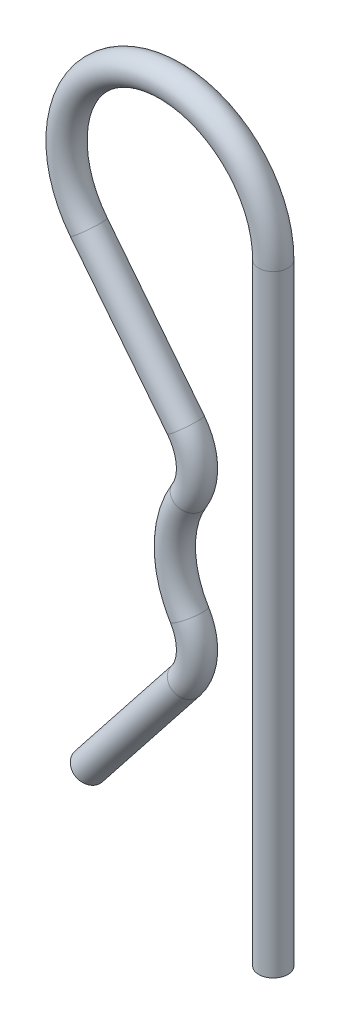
ISO-10303-21;
HEADER;
FILE_DESCRIPTION(('STEP AP214'),'2;1');
FILE_NAME('part.step','',(''),(''),'','','');
FILE_SCHEMA(('AUTOMOTIVE_DESIGN { 1 0 10303 214 1 1 1 1 }'));
ENDSEC;
DATA;
#1=APPLICATION_CONTEXT('core data for automotive mechanical design processes');
#2=APPLICATION_PROTOCOL_DEFINITION('international standard','automotive_design',2000,#1);
#3=PRODUCT_CONTEXT('',#1,'mechanical');
#4=PRODUCT('Part','Part','',(#3));
#5=PRODUCT_RELATED_PRODUCT_CATEGORY('part','',(#4));
#6=PRODUCT_DEFINITION_FORMATION('','',#4);
#7=PRODUCT_DEFINITION_CONTEXT('part definition',#1,'design');
#8=PRODUCT_DEFINITION('design','',#6,#7);
#9=PRODUCT_DEFINITION_SHAPE('','',#8);
#10=(LENGTH_UNIT() NAMED_UNIT(*) SI_UNIT(.MILLI.,.METRE.));
#11=(NAMED_UNIT(*) PLANE_ANGLE_UNIT() SI_UNIT($,.RADIAN.));
#12=(NAMED_UNIT(*) SI_UNIT($,.STERADIAN.) SOLID_ANGLE_UNIT());
#13=UNCERTAINTY_MEASURE_WITH_UNIT(LENGTH_MEASURE(1.E-05),#10,'distance_accuracy_value','');
#14=(GEOMETRIC_REPRESENTATION_CONTEXT(3) GLOBAL_UNCERTAINTY_ASSIGNED_CONTEXT((#13)) GLOBAL_UNIT_ASSIGNED_CONTEXT((#10,
#11,#12)) REPRESENTATION_CONTEXT('',''));
#15=CARTESIAN_POINT('',(0.,0.,0.));
#16=DIRECTION('',(0.,0.,1.));
#17=DIRECTION('',(1.,0.,0.));
#18=AXIS2_PLACEMENT_3D('',#15,#16,#17);
#19=CARTESIAN_POINT('',(-7.18951827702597,-9.09784737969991,0.));
#20=DIRECTION('',(-0.62001648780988,-0.784588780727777,0.));
#21=DIRECTION('',(0.784588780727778,-0.62001648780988,0.));
#22=AXIS2_PLACEMENT_3D('',#19,#20,#21);
#23=CYLINDRICAL_SURFACE('',#22,1.2);
#24=CARTESIAN_POINT('',(-7.18951827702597,-9.09784737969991,0.));
#25=DIRECTION('',(-0.620016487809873,-0.784588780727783,0.));
#26=DIRECTION('',(0.,0.,1.));
#27=AXIS2_PLACEMENT_3D('',#24,#25,#26);
#28=CIRCLE('',#27,1.2);
#29=CARTESIAN_POINT('',(-6.24801174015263,-9.84186716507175,0.));
#30=VERTEX_POINT('',#29);
#31=EDGE_CURVE('E30',#30,#30,#28,.T.);
#32=CARTESIAN_POINT('',(-15.1690046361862,-19.195345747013,0.));
#33=DIRECTION('',(-0.620016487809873,-0.784588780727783,0.));
#34=DIRECTION('',(0.,0.,1.));
#35=AXIS2_PLACEMENT_3D('',#32,#33,#34);
#36=CIRCLE('',#35,1.2);
#37=CARTESIAN_POINT('',(-14.2274980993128,-19.9393655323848,0.));
#38=VERTEX_POINT('',#37);
#39=EDGE_CURVE('E10',#38,#38,#36,.T.);
#40=CARTESIAN_POINT('',(-6.24801174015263,-9.84186716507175,0.));
#41=CARTESIAN_POINT('',(-6.33113138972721,-9.94704943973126,0.));
#42=CARTESIAN_POINT('',(-6.4142510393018,-10.0522317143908,0.));
#43=CARTESIAN_POINT('',(-6.58049033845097,-10.2625962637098,0.));
#44=CARTESIAN_POINT('',(-6.66360998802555,-10.3677785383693,0.));
#45=CARTESIAN_POINT('',(-6.82984928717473,-10.5781430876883,0.));
#46=CARTESIAN_POINT('',(-6.91296893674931,-10.6833253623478,0.));
#47=CARTESIAN_POINT('',(-7.07920823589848,-10.8936899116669,0.));
#48=CARTESIAN_POINT('',(-7.16232788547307,-10.9988721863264,0.));
#49=CARTESIAN_POINT('',(-7.32856718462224,-11.2092367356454,0.));
#50=CARTESIAN_POINT('',(-7.41168683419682,-11.3144190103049,0.));
#51=CARTESIAN_POINT('',(-7.57792613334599,-11.5247835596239,0.));
#52=CARTESIAN_POINT('',(-7.66104578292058,-11.6299658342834,0.));
#53=CARTESIAN_POINT('',(-7.82728508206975,-11.8403303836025,0.));
#54=CARTESIAN_POINT('',(-7.91040473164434,-11.945512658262,0.));
#55=CARTESIAN_POINT('',(-8.07664403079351,-12.155877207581,0.));
#56=CARTESIAN_POINT('',(-8.15976368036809,-12.2610594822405,0.));
#57=CARTESIAN_POINT('',(-8.32600297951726,-12.4714240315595,0.));
#58=CARTESIAN_POINT('',(-8.40912262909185,-12.576606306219,0.));
#59=CARTESIAN_POINT('',(-8.57536192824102,-12.7869708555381,0.));
#60=CARTESIAN_POINT('',(-8.65848157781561,-12.8921531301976,0.));
#61=CARTESIAN_POINT('',(-8.82472087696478,-13.1025176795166,0.));
#62=CARTESIAN_POINT('',(-8.90784052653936,-13.2076999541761,0.));
#63=CARTESIAN_POINT('',(-9.07407982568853,-13.4180645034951,0.));
#64=CARTESIAN_POINT('',(-9.15719947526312,-13.5232467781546,0.));
#65=CARTESIAN_POINT('',(-9.32343877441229,-13.7336113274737,0.));
#66=CARTESIAN_POINT('',(-9.40655842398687,-13.8387936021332,0.));
#67=CARTESIAN_POINT('',(-9.57279772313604,-14.0491581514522,0.));
#68=CARTESIAN_POINT('',(-9.65591737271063,-14.1543404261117,0.));
#69=CARTESIAN_POINT('',(-9.8221566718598,-14.3647049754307,0.));
#70=CARTESIAN_POINT('',(-9.90527632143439,-14.4698872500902,0.));
#71=CARTESIAN_POINT('',(-10.0715156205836,-14.6802517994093,0.));
#72=CARTESIAN_POINT('',(-10.1546352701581,-14.7854340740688,0.));
#73=CARTESIAN_POINT('',(-10.3208745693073,-14.9957986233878,0.));
#74=CARTESIAN_POINT('',(-10.4039942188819,-15.1009808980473,0.));
#75=CARTESIAN_POINT('',(-10.5702335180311,-15.3113454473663,0.));
#76=CARTESIAN_POINT('',(-10.6533531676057,-15.4165277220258,0.));
#77=CARTESIAN_POINT('',(-10.8195924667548,-15.6268922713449,0.));
#78=CARTESIAN_POINT('',(-10.9027121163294,-15.7320745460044,0.));
#79=CARTESIAN_POINT('',(-11.0689514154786,-15.9424390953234,0.));
#80=CARTESIAN_POINT('',(-11.1520710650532,-16.0476213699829,0.));
#81=CARTESIAN_POINT('',(-11.3183103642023,-16.2579859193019,0.));
#82=CARTESIAN_POINT('',(-11.4014300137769,-16.3631681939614,0.));
#83=CARTESIAN_POINT('',(-11.5676693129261,-16.5735327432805,0.));
#84=CARTESIAN_POINT('',(-11.6507889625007,-16.67871501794,0.));
#85=CARTESIAN_POINT('',(-11.8170282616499,-16.889079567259,0.));
#86=CARTESIAN_POINT('',(-11.9001479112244,-16.9942618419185,0.));
#87=CARTESIAN_POINT('',(-12.0663872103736,-17.2046263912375,0.));
#88=CARTESIAN_POINT('',(-12.1495068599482,-17.309808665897,0.));
#89=CARTESIAN_POINT('',(-12.3157461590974,-17.5201732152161,0.));
#90=CARTESIAN_POINT('',(-12.3988658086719,-17.6253554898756,0.));
#91=CARTESIAN_POINT('',(-12.5651051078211,-17.8357200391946,0.));
#92=CARTESIAN_POINT('',(-12.6482247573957,-17.9409023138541,0.));
#93=CARTESIAN_POINT('',(-12.8144640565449,-18.1512668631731,0.));
#94=CARTESIAN_POINT('',(-12.8975837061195,-18.2564491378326,0.));
#95=CARTESIAN_POINT('',(-13.0638230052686,-18.4668136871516,0.));
#96=CARTESIAN_POINT('',(-13.1469426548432,-18.5719959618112,0.));
#97=CARTESIAN_POINT('',(-13.3131819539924,-18.7823605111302,0.));
#98=CARTESIAN_POINT('',(-13.396301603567,-18.8875427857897,0.));
#99=CARTESIAN_POINT('',(-13.5625409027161,-19.0979073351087,0.));
#100=CARTESIAN_POINT('',(-13.6456605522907,-19.2030896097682,0.));
#101=CARTESIAN_POINT('',(-13.8118998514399,-19.4134541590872,0.));
#102=CARTESIAN_POINT('',(-13.8950195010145,-19.5186364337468,0.));
#103=CARTESIAN_POINT('',(-14.0612588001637,-19.7290009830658,0.));
#104=CARTESIAN_POINT('',(-14.1443784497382,-19.8341832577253,0.));
#105=CARTESIAN_POINT('',(-14.2274980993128,-19.9393655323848,0.));
#106=B_SPLINE_CURVE_WITH_KNOTS('',3,(#40,#41,#42,#43,#44,#45,#46,#47,#48,#49,#50,#51,#52,#53,
#54,#55,#56,#57,#58,#59,#60,#61,#62,#63,#64,#65,#66,#67,#68,#69,#70,#71,#72,#73,#74,#75,#76,#77,
#78,#79,#80,#81,#82,#83,#84,#85,#86,#87,#88,#89,#90,#91,#92,#93,#94,#95,#96,#97,#98,#99,#100,
#101,#102,#103,#104,#105),.UNSPECIFIED.,.F.,.F.,(4,2,2,2,2,2,2,2,2,2,2,2,2,2,2,2,2,2,2,2,2,2,2,
2,2,2,2,2,2,2,2,2,4),(0.,0.402181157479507,0.804362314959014,1.20654347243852,1.60872462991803,
2.01090578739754,2.41308694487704,2.81526810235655,3.21744925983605,3.61963041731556,
4.02181157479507,4.42399273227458,4.82617388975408,5.22835504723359,5.6305362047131,
6.0327173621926,6.43489851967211,6.83707967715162,7.23926083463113,7.64144199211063,
8.04362314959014,8.44580430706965,8.84798546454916,9.25016662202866,9.65234777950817,
10.0545289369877,10.4567100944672,10.8588912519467,11.2610724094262,11.6632535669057,
12.0654347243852,12.4676158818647,12.8697970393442),.UNSPECIFIED.);
#107=EDGE_CURVE('BSEAM24',#30,#38,#106,.T.);
#108=ORIENTED_EDGE('',*,*,#31,.T.);
#109=ORIENTED_EDGE('',*,*,#39,.F.);
#110=ORIENTED_EDGE('',*,*,#107,.T.);
#111=ORIENTED_EDGE('',*,*,#107,.F.);
#112=EDGE_LOOP('',(#108,#110,#109,#111));
#113=FACE_BOUND('',#112,.T.);
#114=ADVANCED_FACE('F24',(#113),#23,.T.);
#115=CARTESIAN_POINT('',(-10.5240205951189,-6.46277730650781,0.));
#116=DIRECTION('',(0.,0.,-1.));
#117=DIRECTION('',(-1.,0.,0.));
#118=AXIS2_PLACEMENT_3D('',#115,#116,#117);
#119=TOROIDAL_SURFACE('',#118,4.25,1.2);
#120=CARTESIAN_POINT('',(-6.9023940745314,-4.23874463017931,0.));
#121=DIRECTION('',(0.523301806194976,-0.852147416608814,0.));
#122=DIRECTION('',(0.,0.,1.));
#123=AXIS2_PLACEMENT_3D('',#120,#121,#122);
#124=CIRCLE('',#123,1.2);
#125=CARTESIAN_POINT('',(-5.87981717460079,-3.61078246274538,0.));
#126=VERTEX_POINT('',#125);
#127=EDGE_CURVE('E34',#126,#126,#124,.T.);
#128=CARTESIAN_POINT('',(-10.5240205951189,-6.46277730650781,0.));
#129=DIRECTION('',(0.,0.,-1.));
#130=DIRECTION('',(-1.,0.,0.));
#131=AXIS2_PLACEMENT_3D('',#128,#129,#130);
#132=CIRCLE('',#131,5.45);
#133=EDGE_CURVE('',#126,#30,#132,.T.);
#134=ORIENTED_EDGE('',*,*,#127,.T.);
#135=ORIENTED_EDGE('',*,*,#31,.F.);
#136=ORIENTED_EDGE('',*,*,#133,.T.);
#137=ORIENTED_EDGE('',*,*,#133,.F.);
#138=EDGE_LOOP('',(#134,#136,#135,#137));
#139=FACE_BOUND('',#138,.T.);
#140=ADVANCED_FACE('F67',(#139),#119,.T.);
#141=CARTESIAN_POINT('',(0.,0.,0.));
#142=DIRECTION('',(0.,0.,1.));
#143=DIRECTION('',(1.,0.,0.));
#144=AXIS2_PLACEMENT_3D('',#141,#142,#143);
#145=TOROIDAL_SURFACE('',#144,8.1,1.2);
#146=CARTESIAN_POINT('',(-6.90239407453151,4.23874463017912,0.));
#147=DIRECTION('',(-0.523301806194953,-0.852147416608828,0.));
#148=DIRECTION('',(0.,0.,1.));
#149=AXIS2_PLACEMENT_3D('',#146,#147,#148);
#150=CIRCLE('',#149,1.2);
#151=CARTESIAN_POINT('',(-5.87981717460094,3.61078246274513,0.));
#152=VERTEX_POINT('',#151);
#153=EDGE_CURVE('E38',#152,#152,#150,.T.);
#154=ORIENTED_EDGE('',*,*,#153,.T.);
#155=EDGE_LOOP('',(#154));
#156=FACE_BOUND('',#155,.T.);
#157=ORIENTED_EDGE('',*,*,#127,.F.);
#158=EDGE_LOOP('',(#157));
#159=FACE_BOUND('',#158,.T.);
#160=ADVANCED_FACE('F71',(#156,#159),#145,.T.);
#161=CARTESIAN_POINT('',(-10.5240205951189,6.46277730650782,0.));
#162=DIRECTION('',(0.,0.,-1.));
#163=DIRECTION('',(-1.,0.,0.));
#164=AXIS2_PLACEMENT_3D('',#161,#162,#163);
#165=TOROIDAL_SURFACE('',#164,4.25,1.2);
#166=CARTESIAN_POINT('',(-7.18951827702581,9.09784737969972,0.));
#167=DIRECTION('',(0.620016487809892,-0.784588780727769,0.));
#168=DIRECTION('',(0.,0.,1.));
#169=AXIS2_PLACEMENT_3D('',#166,#167,#168);
#170=CIRCLE('',#169,1.2);
#171=CARTESIAN_POINT('',(-6.24801174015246,9.84186716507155,0.));
#172=VERTEX_POINT('',#171);
#173=EDGE_CURVE('E43',#172,#172,#170,.T.);
#174=CARTESIAN_POINT('',(-10.5240205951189,6.46277730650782,0.));
#175=DIRECTION('',(0.,0.,-1.));
#176=DIRECTION('',(-1.,0.,0.));
#177=AXIS2_PLACEMENT_3D('',#174,#175,#176);
#178=CIRCLE('',#177,5.45);
#179=EDGE_CURVE('',#172,#152,#178,.T.);
#180=ORIENTED_EDGE('',*,*,#173,.T.);
#181=ORIENTED_EDGE('',*,*,#153,.F.);
#182=ORIENTED_EDGE('',*,*,#179,.T.);
#183=ORIENTED_EDGE('',*,*,#179,.F.);
#184=EDGE_LOOP('',(#180,#182,#181,#183));
#185=FACE_BOUND('',#184,.T.);
#186=ADVANCED_FACE('F77',(#185),#165,.T.);
#187=CARTESIAN_POINT('',(-15.169004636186,19.1953457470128,0.));
#188=DIRECTION('',(0.620016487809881,-0.784588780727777,0.));
#189=DIRECTION('',(0.784588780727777,0.620016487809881,0.));
#190=AXIS2_PLACEMENT_3D('',#187,#188,#189);
#191=CYLINDRICAL_SURFACE('',#190,1.2);
#192=CARTESIAN_POINT('',(-15.169004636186,19.1953457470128,0.));
#193=DIRECTION('',(0.620016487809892,-0.784588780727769,0.));
#194=DIRECTION('',(0.,0.,1.));
#195=AXIS2_PLACEMENT_3D('',#192,#193,#194);
#196=CIRCLE('',#195,1.2);
#197=CARTESIAN_POINT('',(-16.1105111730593,18.4513259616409,0.));
#198=VERTEX_POINT('',#197);
#199=EDGE_CURVE('E46',#198,#198,#196,.T.);
#200=ORIENTED_EDGE('',*,*,#199,.T.);
#201=EDGE_LOOP('',(#200));
#202=FACE_BOUND('',#201,.T.);
#203=ORIENTED_EDGE('',*,*,#173,.F.);
#204=EDGE_LOOP('',(#203));
#205=FACE_BOUND('',#204,.T.);
#206=ADVANCED_FACE('F84',(#202,#205),#191,.T.);
#207=CARTESIAN_POINT('',(-8.5,24.4654858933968,0.));
#208=DIRECTION('',(0.,0.,1.));
#209=DIRECTION('',(1.,0.,0.));
#210=AXIS2_PLACEMENT_3D('',#207,#208,#209);
#211=TOROIDAL_SURFACE('',#210,8.49999999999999,1.2);
#212=CARTESIAN_POINT('',(0.,24.4654858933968,0.));
#213=DIRECTION('',(0.,1.,0.));
#214=DIRECTION('',(0.,0.,1.));
#215=AXIS2_PLACEMENT_3D('',#212,#213,#214);
#216=CIRCLE('',#215,1.2);
#217=CARTESIAN_POINT('',(1.19999999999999,24.4654858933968,0.));
#218=VERTEX_POINT('',#217);
#219=EDGE_CURVE('E49',#218,#218,#216,.T.);
#220=CARTESIAN_POINT('',(-8.5,24.4654858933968,0.));
#221=DIRECTION('',(0.,0.,1.));
#222=DIRECTION('',(1.,0.,0.));
#223=AXIS2_PLACEMENT_3D('',#220,#221,#222);
#224=CIRCLE('',#223,9.69999999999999);
#225=EDGE_CURVE('',#218,#198,#224,.T.);
#226=ORIENTED_EDGE('',*,*,#219,.T.);
#227=ORIENTED_EDGE('',*,*,#199,.F.);
#228=ORIENTED_EDGE('',*,*,#225,.T.);
#229=ORIENTED_EDGE('',*,*,#225,.F.);
#230=EDGE_LOOP('',(#226,#228,#227,#229));
#231=FACE_BOUND('',#230,.T.);
#232=ADVANCED_FACE('F88',(#231),#211,.T.);
#233=CARTESIAN_POINT('',(0.,24.4654858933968,0.));
#234=DIRECTION('',(0.,-1.,0.));
#235=DIRECTION('',(1.,0.,0.));
#236=AXIS2_PLACEMENT_3D('',#233,#234,#235);
#237=CYLINDRICAL_SURFACE('',#236,1.2);
#238=ORIENTED_EDGE('',*,*,#219,.F.);
#239=EDGE_LOOP('',(#238));
#240=FACE_BOUND('',#239,.T.);
#241=CARTESIAN_POINT('',(0.,-25.8345141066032,0.));
#242=DIRECTION('',(0.,1.,0.));
#243=DIRECTION('',(0.,0.,1.));
#244=AXIS2_PLACEMENT_3D('',#241,#242,#243);
#245=CIRCLE('',#244,1.2);
#246=CARTESIAN_POINT('',(0.,-25.8345141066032,1.2));
#247=VERTEX_POINT('',#246);
#248=EDGE_CURVE('E52',#247,#247,#245,.T.);
#249=ORIENTED_EDGE('',*,*,#248,.T.);
#250=EDGE_LOOP('',(#249));
#251=FACE_BOUND('',#250,.T.);
#252=ADVANCED_FACE('F56',(#240,#251),#237,.T.);
#253=CARTESIAN_POINT('',(-15.1690046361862,-19.195345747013,0.));
#254=DIRECTION('',(-0.620016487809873,-0.784588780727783,0.));
#255=DIRECTION('',(0.,0.,1.));
#256=AXIS2_PLACEMENT_3D('',#253,#254,#255);
#257=PLANE('',#256);
#258=ORIENTED_EDGE('',*,*,#39,.T.);
#259=EDGE_LOOP('',(#258));
#260=FACE_BOUND('',#259,.T.);
#261=ADVANCED_FACE('F60',(#260),#257,.T.);
#262=CARTESIAN_POINT('',(0.,-25.8345141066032,0.));
#263=DIRECTION('',(0.,1.,0.));
#264=DIRECTION('',(0.,0.,1.));
#265=AXIS2_PLACEMENT_3D('',#262,#263,#264);
#266=PLANE('',#265);
#267=ORIENTED_EDGE('',*,*,#248,.F.);
#268=EDGE_LOOP('',(#267));
#269=FACE_BOUND('',#268,.T.);
#270=ADVANCED_FACE('F58',(#269),#266,.F.);
#271=CLOSED_SHELL('',(#114,#140,#160,#186,#206,#232,#252,#261,#270));
#272=MANIFOLD_SOLID_BREP('B2',#271);
#273=ADVANCED_BREP_SHAPE_REPRESENTATION('',(#18,#272),#14);
#274=SHAPE_DEFINITION_REPRESENTATION(#9,#273);
ENDSEC;
END-ISO-10303-21;
